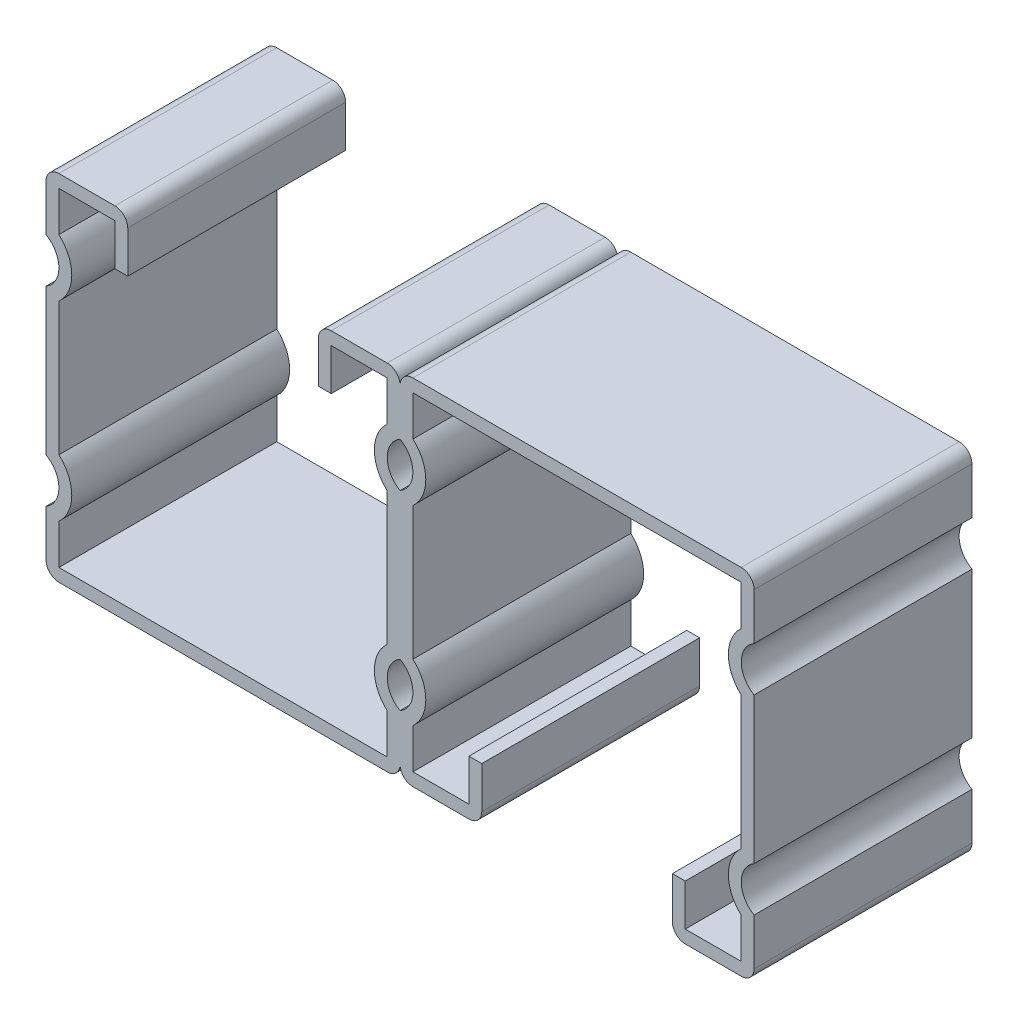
from build123d import *

# Parameters (mm, degrees)
BASE_EXTRUDE_DEPTH = 12.7
CIRPATTERN1_COUNT  = 2


with BuildPart() as part:
    # Sketch1 → Base-Extrude (new, symmetric)
    with BuildSketch(Plane.XY):
        with BuildLine():
            Line((-41.275, 19.1389), (-41.275, 13.70815134))
            ThreePointArc((-41.275, 13.70815134), (-39.7764, 11.1125), (-41.275, 8.51684866))
            Line((-41.275, 8.51684866), (-41.275, -8.51684866))
            ThreePointArc((-41.275, -8.51684866), (-39.7764, -11.1125), (-41.275, -13.70815134))
            Line((-41.275, -13.70815134), (-41.275, -19.1389))
            ThreePointArc((-41.275, -19.1389), (-40.836070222, -20.198570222), (-39.7764, -20.6375))
            Line((-39.7764, -20.6375), (-1.4986, -20.6375))
            ThreePointArc((-1.4986, -20.6375), (-0.438929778, -20.198570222), (0, -19.1389))
            Line((0, -19.1389), (0, -13.70815134))
            ThreePointArc((0, -13.70815134), (-1.4986, -11.1125), (0, -8.51684866))
            Line((0, -8.51684866), (0, 8.51684866))
            ThreePointArc((0, 8.51684866), (-1.4986, 11.1125), (0, 13.70815134))
            Line((0, 13.70815134), (0, 19.1389))
            ThreePointArc((0, 19.1389), (-0.438929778, 20.198570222), (-1.4986, 20.6375))
            Line((-1.4986, 20.6375), (-8.0264, 20.6375))
            ThreePointArc((-8.0264, 20.6375), (-9.086070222, 20.198570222), (-9.525, 19.1389))
            Line((-9.525, 19.1389), (-9.525, 14.2875))
            Line((-9.525, 14.2875), (-8.0264, 14.2875))
            Line((-8.0264, 14.2875), (-8.0264, 19.1389))
            Line((-8.0264, 19.1389), (-1.4986, 19.1389))
            Line((-1.4986, 19.1389), (-1.4986, 14.463471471))
            ThreePointArc((-1.4986, 14.463471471), (-2.9972, 11.1125), (-1.4986, 7.761528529))
            Line((-1.4986, 7.761528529), (-1.4986, -7.761528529))
            ThreePointArc((-1.4986, -7.761528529), (-2.9972, -11.1125), (-1.4986, -14.463471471))
            Line((-1.4986, -14.463471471), (-1.4986, -19.1389))
            Line((-1.4986, -19.1389), (-39.7764, -19.1389))
            Line((-39.7764, -19.1389), (-39.7764, -14.463471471))
            ThreePointArc((-39.7764, -14.463471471), (-38.2778, -11.1125), (-39.7764, -7.761528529))
            Line((-39.7764, -7.761528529), (-39.7764, 7.761528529))
            ThreePointArc((-39.7764, 7.761528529), (-38.2778, 11.1125), (-39.7764, 14.463471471))
            Line((-39.7764, 14.463471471), (-39.7764, 19.1389))
            Line((-39.7764, 19.1389), (-33.2486, 19.1389))
            Line((-33.2486, 19.1389), (-33.2486, 14.2875))
            Line((-33.2486, 14.2875), (-31.75, 14.2875))
            Line((-31.75, 14.2875), (-31.75, 19.1389))
            ThreePointArc((-31.75, 19.1389), (-32.188929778, 20.198570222), (-33.2486, 20.6375))
            Line((-33.2486, 20.6375), (-39.7764, 20.6375))
            ThreePointArc((-39.7764, 20.6375), (-40.836070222, 20.198570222), (-41.275, 19.1389))
        make_face()
    base_extrude = extrude(amount=BASE_EXTRUDE_DEPTH, both=True)

    # CirPattern1: Base-Extrude ×2 about axis
    cirpattern1_axis = Axis((0, 0, 0), (0, 0, 1))
    for i in range(1, CIRPATTERN1_COUNT):
        add(base_extrude.rotate(cirpattern1_axis, i * 360 / CIRPATTERN1_COUNT))


solid = part.part
